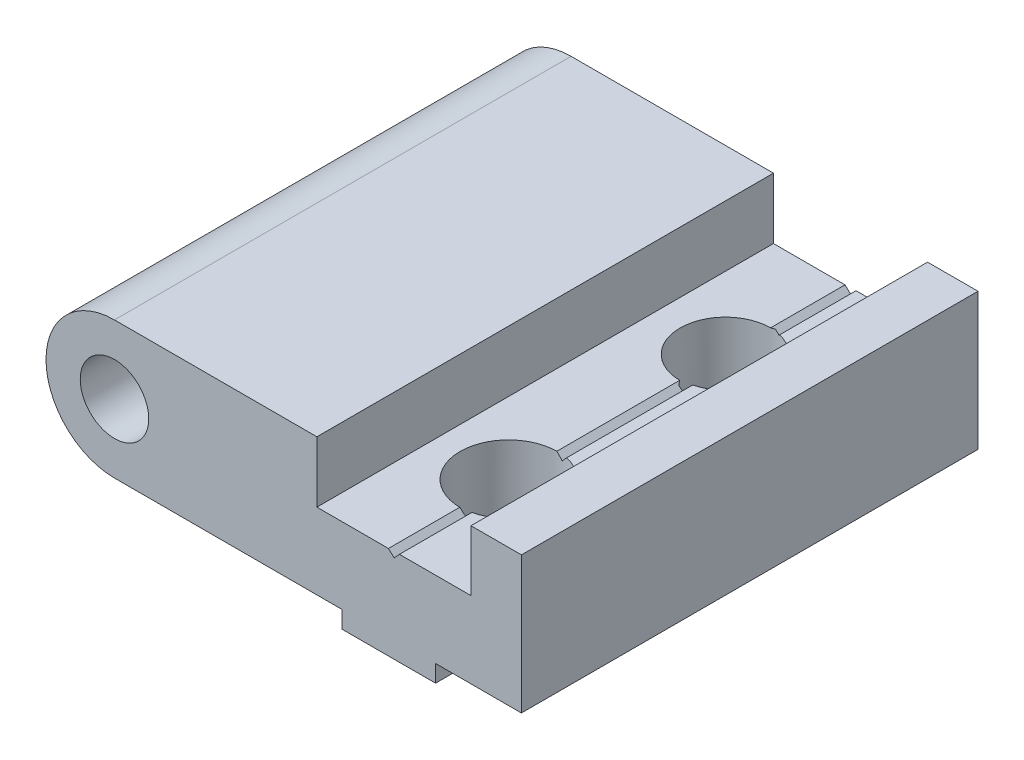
ISO-10303-21;
HEADER;
FILE_DESCRIPTION(('STEP AP214'),'2;1');
FILE_NAME('part.step','',(''),(''),'','','');
FILE_SCHEMA(('AUTOMOTIVE_DESIGN { 1 0 10303 214 1 1 1 1 }'));
ENDSEC;
DATA;
#1=APPLICATION_CONTEXT('core data for automotive mechanical design processes');
#2=APPLICATION_PROTOCOL_DEFINITION('international standard','automotive_design',2000,#1);
#3=PRODUCT_CONTEXT('',#1,'mechanical');
#4=PRODUCT('Part','Part','',(#3));
#5=PRODUCT_RELATED_PRODUCT_CATEGORY('part','',(#4));
#6=PRODUCT_DEFINITION_FORMATION('','',#4);
#7=PRODUCT_DEFINITION_CONTEXT('part definition',#1,'design');
#8=PRODUCT_DEFINITION('design','',#6,#7);
#9=PRODUCT_DEFINITION_SHAPE('','',#8);
#10=(LENGTH_UNIT() NAMED_UNIT(*) SI_UNIT(.MILLI.,.METRE.));
#11=(NAMED_UNIT(*) PLANE_ANGLE_UNIT() SI_UNIT($,.RADIAN.));
#12=(NAMED_UNIT(*) SI_UNIT($,.STERADIAN.) SOLID_ANGLE_UNIT());
#13=UNCERTAINTY_MEASURE_WITH_UNIT(LENGTH_MEASURE(1.E-05),#10,'distance_accuracy_value','');
#14=(GEOMETRIC_REPRESENTATION_CONTEXT(3) GLOBAL_UNCERTAINTY_ASSIGNED_CONTEXT((#13)) GLOBAL_UNIT_ASSIGNED_CONTEXT((#10,
#11,#12)) REPRESENTATION_CONTEXT('',''));
#15=CARTESIAN_POINT('',(0.,0.,0.));
#16=DIRECTION('',(0.,0.,1.));
#17=DIRECTION('',(1.,0.,0.));
#18=AXIS2_PLACEMENT_3D('',#15,#16,#17);
#19=CARTESIAN_POINT('',(0.463182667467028,6.69712197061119,0.));
#20=DIRECTION('',(-0.733599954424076,0.679581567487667,0.));
#21=DIRECTION('',(-0.679581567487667,-0.733599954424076,0.));
#22=AXIS2_PLACEMENT_3D('',#19,#20,#21);
#23=PLANE('',#22);
#24=DIRECTION('',(0.,0.,1.));
#25=VECTOR('',#24,1.);
#26=CARTESIAN_POINT('',(0.463182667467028,6.69712197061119,0.));
#27=LINE('',#26,#25);
#28=CARTESIAN_POINT('',(0.463182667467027,6.69712197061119,-25.6908944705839));
#29=VERTEX_POINT('',#28);
#30=CARTESIAN_POINT('',(0.463182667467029,6.69712197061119,-14.6461089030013));
#31=VERTEX_POINT('',#30);
#32=EDGE_CURVE('E238',#29,#31,#27,.T.);
#33=ORIENTED_EDGE('',*,*,#32,.F.);
#34=CARTESIAN_POINT('',(0.463182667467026,6.69712197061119,-25.6908944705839));
#35=CARTESIAN_POINT('',(0.43318842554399,6.66474355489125,-25.6281035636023));
#36=CARTESIAN_POINT('',(0.402974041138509,6.63212749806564,-25.565545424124));
#37=CARTESIAN_POINT('',(0.34210505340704,6.5664201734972,-25.4408948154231));
#38=CARTESIAN_POINT('',(0.311450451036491,6.53332890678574,-25.3788023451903));
#39=CARTESIAN_POINT('',(0.280575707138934,6.5,-25.3169426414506));
#40=B_SPLINE_CURVE_WITH_KNOTS('',3,(#34,#35,#36,#37,#38,#39),.UNSPECIFIED.,.F.,.F.,(4,2,4),(0.,
0.230243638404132,0.460486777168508),.UNSPECIFIED.);
#41=CARTESIAN_POINT('',(0.280575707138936,6.5,-25.3169426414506));
#42=VERTEX_POINT('',#41);
#43=EDGE_CURVE('E236',#29,#42,#40,.T.);
#44=ORIENTED_EDGE('',*,*,#43,.T.);
#45=CARTESIAN_POINT('',(-0.47077716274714,5.68892380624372,-29.5));
#46=DIRECTION('',(-0.733599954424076,0.679581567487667,0.));
#47=DIRECTION('',(0.679581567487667,0.733599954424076,0.));
#48=AXIS2_PLACEMENT_3D('',#45,#46,#47);
#49=ELLIPSE('',#48,6.25384825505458,4.25);
#50=CARTESIAN_POINT('',(0.,6.19712197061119,-25.2761547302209));
#51=VERTEX_POINT('',#50);
#52=EDGE_CURVE('E20',#42,#51,#49,.F.);
#53=ORIENTED_EDGE('',*,*,#52,.T.);
#54=DIRECTION('',(0.,0.,1.));
#55=VECTOR('',#54,1.);
#56=CARTESIAN_POINT('',(0.,6.19712197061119,0.));
#57=LINE('',#56,#55);
#58=CARTESIAN_POINT('',(0.,6.19712197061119,-14.7238452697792));
#59=VERTEX_POINT('',#58);
#60=EDGE_CURVE('E278',#59,#51,#57,.F.);
#61=ORIENTED_EDGE('',*,*,#60,.F.);
#62=CARTESIAN_POINT('',(-0.47077716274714,5.68892380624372,-10.5));
#63=DIRECTION('',(-0.733599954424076,0.679581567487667,0.));
#64=DIRECTION('',(0.679581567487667,0.733599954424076,0.));
#65=AXIS2_PLACEMENT_3D('',#62,#63,#64);
#66=ELLIPSE('',#65,6.25384825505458,4.25);
#67=EDGE_CURVE('E234',#59,#31,#66,.F.);
#68=ORIENTED_EDGE('',*,*,#67,.T.);
#69=EDGE_LOOP('',(#33,#44,#53,#61,#68));
#70=FACE_BOUND('',#69,.T.);
#71=ADVANCED_FACE('F16',(#70),#23,.T.);
#72=CARTESIAN_POINT('',(0.463182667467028,6.69712197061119,0.));
#73=DIRECTION('',(-0.733599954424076,0.679581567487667,0.));
#74=DIRECTION('',(-0.679581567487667,-0.733599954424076,0.));
#75=AXIS2_PLACEMENT_3D('',#72,#73,#74);
#76=PLANE('',#75);
#77=DIRECTION('',(-0.679581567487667,-0.733599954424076,0.));
#78=VECTOR('',#77,1.);
#79=CARTESIAN_POINT('',(0.463182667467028,6.69712197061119,0.));
#80=LINE('',#79,#78);
#81=CARTESIAN_POINT('',(0.,6.19712197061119,0.));
#82=VERTEX_POINT('',#81);
#83=CARTESIAN_POINT('',(0.463182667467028,6.69712197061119,0.));
#84=VERTEX_POINT('',#83);
#85=EDGE_CURVE('E302',#82,#84,#80,.F.);
#86=ORIENTED_EDGE('',*,*,#85,.T.);
#87=DIRECTION('',(0.,0.,1.));
#88=VECTOR('',#87,1.);
#89=CARTESIAN_POINT('',(0.463182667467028,6.69712197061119,0.));
#90=LINE('',#89,#88);
#91=CARTESIAN_POINT('',(0.463182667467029,6.69712197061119,-6.35389109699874));
#92=VERTEX_POINT('',#91);
#93=EDGE_CURVE('E640',#92,#84,#90,.T.);
#94=ORIENTED_EDGE('',*,*,#93,.F.);
#95=CARTESIAN_POINT('',(-0.47077716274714,5.68892380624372,-10.5));
#96=DIRECTION('',(-0.733599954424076,0.679581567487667,0.));
#97=DIRECTION('',(0.679581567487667,0.733599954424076,0.));
#98=AXIS2_PLACEMENT_3D('',#95,#96,#97);
#99=ELLIPSE('',#98,6.25384825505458,4.25);
#100=CARTESIAN_POINT('',(0.,6.19712197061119,-6.27615473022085));
#101=VERTEX_POINT('',#100);
#102=EDGE_CURVE('E304',#92,#101,#99,.F.);
#103=ORIENTED_EDGE('',*,*,#102,.T.);
#104=DIRECTION('',(0.,0.,1.));
#105=VECTOR('',#104,1.);
#106=CARTESIAN_POINT('',(0.,6.19712197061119,0.));
#107=LINE('',#106,#105);
#108=EDGE_CURVE('E281',#82,#101,#107,.F.);
#109=ORIENTED_EDGE('',*,*,#108,.F.);
#110=EDGE_LOOP('',(#86,#94,#103,#109));
#111=FACE_BOUND('',#110,.T.);
#112=ADVANCED_FACE('F745',(#111),#76,.T.);
#113=CARTESIAN_POINT('',(0.463182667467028,6.69712197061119,0.));
#114=DIRECTION('',(-0.733599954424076,0.679581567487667,0.));
#115=DIRECTION('',(-0.679581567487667,-0.733599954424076,0.));
#116=AXIS2_PLACEMENT_3D('',#113,#114,#115);
#117=PLANE('',#116);
#118=DIRECTION('',(-0.679581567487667,-0.733599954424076,0.));
#119=VECTOR('',#118,1.);
#120=CARTESIAN_POINT('',(0.463182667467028,6.69712197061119,-40.));
#121=LINE('',#120,#119);
#122=CARTESIAN_POINT('',(0.463182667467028,6.69712197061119,-40.));
#123=VERTEX_POINT('',#122);
#124=CARTESIAN_POINT('',(0.,6.19712197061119,-40.));
#125=VERTEX_POINT('',#124);
#126=EDGE_CURVE('E294',#123,#125,#121,.T.);
#127=ORIENTED_EDGE('',*,*,#126,.T.);
#128=DIRECTION('',(0.,0.,1.));
#129=VECTOR('',#128,1.);
#130=CARTESIAN_POINT('',(0.,6.19712197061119,0.));
#131=LINE('',#130,#129);
#132=CARTESIAN_POINT('',(0.,6.19712197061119,-33.7238452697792));
#133=VERTEX_POINT('',#132);
#134=EDGE_CURVE('E288',#133,#125,#131,.F.);
#135=ORIENTED_EDGE('',*,*,#134,.F.);
#136=CARTESIAN_POINT('',(-0.47077716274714,5.68892380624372,-29.5));
#137=DIRECTION('',(-0.733599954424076,0.679581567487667,0.));
#138=DIRECTION('',(0.679581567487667,0.733599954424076,0.));
#139=AXIS2_PLACEMENT_3D('',#136,#137,#138);
#140=ELLIPSE('',#139,6.25384825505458,4.25);
#141=CARTESIAN_POINT('',(0.280575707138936,6.5,-33.6830573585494));
#142=VERTEX_POINT('',#141);
#143=EDGE_CURVE('E296',#133,#142,#140,.F.);
#144=ORIENTED_EDGE('',*,*,#143,.T.);
#145=CARTESIAN_POINT('',(0.280575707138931,6.5,-33.6830573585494));
#146=CARTESIAN_POINT('',(0.311450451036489,6.53332890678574,-33.6211976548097));
#147=CARTESIAN_POINT('',(0.342105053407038,6.56642017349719,-33.5591051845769));
#148=CARTESIAN_POINT('',(0.402974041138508,6.63212749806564,-33.4344545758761));
#149=CARTESIAN_POINT('',(0.433188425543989,6.66474355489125,-33.3718964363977));
#150=CARTESIAN_POINT('',(0.463182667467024,6.69712197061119,-33.3091055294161));
#151=B_SPLINE_CURVE_WITH_KNOTS('',3,(#145,#146,#147,#148,#149,#150),.UNSPECIFIED.,.F.,.F.,(4,2,
4),(0.,0.230243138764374,0.460486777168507),.UNSPECIFIED.);
#152=CARTESIAN_POINT('',(0.463182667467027,6.69712197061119,-33.3091055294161));
#153=VERTEX_POINT('',#152);
#154=EDGE_CURVE('E242',#142,#153,#151,.T.);
#155=ORIENTED_EDGE('',*,*,#154,.T.);
#156=DIRECTION('',(0.,0.,1.));
#157=VECTOR('',#156,1.);
#158=CARTESIAN_POINT('',(0.463182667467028,6.69712197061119,0.));
#159=LINE('',#158,#157);
#160=EDGE_CURVE('E634',#123,#153,#159,.T.);
#161=ORIENTED_EDGE('',*,*,#160,.F.);
#162=EDGE_LOOP('',(#127,#135,#144,#155,#161));
#163=FACE_BOUND('',#162,.T.);
#164=ADVANCED_FACE('F738',(#163),#117,.T.);
#165=CARTESIAN_POINT('',(0.,6.19712197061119,0.));
#166=DIRECTION('',(0.679581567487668,0.733599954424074,0.));
#167=DIRECTION('',(-0.733599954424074,0.679581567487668,0.));
#168=AXIS2_PLACEMENT_3D('',#165,#166,#167);
#169=PLANE('',#168);
#170=DIRECTION('',(-0.733599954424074,0.679581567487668,0.));
#171=VECTOR('',#170,1.);
#172=CARTESIAN_POINT('',(0.,6.19712197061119,-40.));
#173=LINE('',#172,#171);
#174=CARTESIAN_POINT('',(-0.5,6.66030463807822,-40.));
#175=VERTEX_POINT('',#174);
#176=EDGE_CURVE('E291',#125,#175,#173,.T.);
#177=ORIENTED_EDGE('',*,*,#176,.T.);
#178=DIRECTION('',(0.,0.,1.));
#179=VECTOR('',#178,1.);
#180=CARTESIAN_POINT('',(-0.5,6.66030463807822,0.));
#181=LINE('',#180,#179);
#182=CARTESIAN_POINT('',(-0.499999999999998,6.66030463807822,-33.4831010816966));
#183=VERTEX_POINT('',#182);
#184=EDGE_CURVE('E631',#183,#175,#181,.F.);
#185=ORIENTED_EDGE('',*,*,#184,.F.);
#186=CARTESIAN_POINT('',(-0.499999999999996,6.66030463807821,-33.4831010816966));
#187=CARTESIAN_POINT('',(-0.471370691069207,6.63378343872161,-33.5274361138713));
#188=CARTESIAN_POINT('',(-0.442635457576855,6.60716411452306,-33.5716423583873));
#189=CARTESIAN_POINT('',(-0.384953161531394,6.55372923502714,-33.6597972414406));
#190=CARTESIAN_POINT('',(-0.35600609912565,6.52691367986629,-33.7037458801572));
#191=CARTESIAN_POINT('',(-0.326953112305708,6.5,-33.7475657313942));
#192=B_SPLINE_CURVE_WITH_KNOTS('',3,(#186,#187,#188,#189,#190,#191),.UNSPECIFIED.,.F.,.F.,(4,2,
4),(0.,0.177190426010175,0.354380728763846),.UNSPECIFIED.);
#193=CARTESIAN_POINT('',(-0.32695311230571,6.5,-33.7475657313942));
#194=VERTEX_POINT('',#193);
#195=EDGE_CURVE('E423',#183,#194,#192,.T.);
#196=ORIENTED_EDGE('',*,*,#195,.T.);
#197=CARTESIAN_POINT('',(-0.47077716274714,6.63323361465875,-29.5));
#198=DIRECTION('',(0.679581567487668,0.733599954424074,0.));
#199=DIRECTION('',(-0.733599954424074,0.679581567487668,0.));
#200=AXIS2_PLACEMENT_3D('',#197,#198,#199);
#201=ELLIPSE('',#200,5.7933482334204,4.25);
#202=EDGE_CURVE('E292',#194,#133,#201,.F.);
#203=ORIENTED_EDGE('',*,*,#202,.T.);
#204=ORIENTED_EDGE('',*,*,#134,.T.);
#205=EDGE_LOOP('',(#177,#185,#196,#203,#204));
#206=FACE_BOUND('',#205,.T.);
#207=ADVANCED_FACE('F735',(#206),#169,.T.);
#208=CARTESIAN_POINT('',(0.,6.19712197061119,0.));
#209=DIRECTION('',(0.679581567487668,0.733599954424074,0.));
#210=DIRECTION('',(-0.733599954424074,0.679581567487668,0.));
#211=AXIS2_PLACEMENT_3D('',#208,#209,#210);
#212=PLANE('',#211);
#213=DIRECTION('',(-0.733599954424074,0.679581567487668,0.));
#214=VECTOR('',#213,1.);
#215=CARTESIAN_POINT('',(0.,6.19712197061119,0.));
#216=LINE('',#215,#214);
#217=CARTESIAN_POINT('',(-0.5,6.66030463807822,0.));
#218=VERTEX_POINT('',#217);
#219=EDGE_CURVE('E284',#218,#82,#216,.F.);
#220=ORIENTED_EDGE('',*,*,#219,.T.);
#221=ORIENTED_EDGE('',*,*,#108,.T.);
#222=CARTESIAN_POINT('',(-0.47077716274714,6.63323361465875,-10.5));
#223=DIRECTION('',(0.679581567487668,0.733599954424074,0.));
#224=DIRECTION('',(-0.733599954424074,0.679581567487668,0.));
#225=AXIS2_PLACEMENT_3D('',#222,#223,#224);
#226=ELLIPSE('',#225,5.7933482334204,4.25);
#227=CARTESIAN_POINT('',(-0.5,6.66030463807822,-6.25010046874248));
#228=VERTEX_POINT('',#227);
#229=EDGE_CURVE('E287',#101,#228,#226,.F.);
#230=ORIENTED_EDGE('',*,*,#229,.T.);
#231=DIRECTION('',(0.,0.,1.));
#232=VECTOR('',#231,1.);
#233=CARTESIAN_POINT('',(-0.5,6.66030463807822,0.));
#234=LINE('',#233,#232);
#235=EDGE_CURVE('E628',#218,#228,#234,.F.);
#236=ORIENTED_EDGE('',*,*,#235,.F.);
#237=EDGE_LOOP('',(#220,#221,#230,#236));
#238=FACE_BOUND('',#237,.T.);
#239=ADVANCED_FACE('F412',(#238),#212,.T.);
#240=CARTESIAN_POINT('',(0.,6.19712197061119,0.));
#241=DIRECTION('',(0.679581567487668,0.733599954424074,0.));
#242=DIRECTION('',(-0.733599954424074,0.679581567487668,0.));
#243=AXIS2_PLACEMENT_3D('',#240,#241,#242);
#244=PLANE('',#243);
#245=ORIENTED_EDGE('',*,*,#60,.T.);
#246=CARTESIAN_POINT('',(-0.47077716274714,6.63323361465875,-29.5));
#247=DIRECTION('',(0.679581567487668,0.733599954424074,0.));
#248=DIRECTION('',(-0.733599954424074,0.679581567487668,0.));
#249=AXIS2_PLACEMENT_3D('',#246,#247,#248);
#250=ELLIPSE('',#249,5.7933482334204,4.25);
#251=CARTESIAN_POINT('',(-0.3269531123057,6.5,-25.2524342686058));
#252=VERTEX_POINT('',#251);
#253=EDGE_CURVE('E230',#51,#252,#250,.F.);
#254=ORIENTED_EDGE('',*,*,#253,.T.);
#255=CARTESIAN_POINT('',(-0.326953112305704,6.5,-25.2524342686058));
#256=CARTESIAN_POINT('',(-0.356006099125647,6.52691367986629,-25.2962541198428));
#257=CARTESIAN_POINT('',(-0.384953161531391,6.55372923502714,-25.3402027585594));
#258=CARTESIAN_POINT('',(-0.442635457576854,6.60716411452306,-25.4283576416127));
#259=CARTESIAN_POINT('',(-0.471370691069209,6.63378343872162,-25.4725638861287));
#260=CARTESIAN_POINT('',(-0.499999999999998,6.66030463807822,-25.5168989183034));
#261=B_SPLINE_CURVE_WITH_KNOTS('',3,(#255,#256,#257,#258,#259,#260),.UNSPECIFIED.,.F.,.F.,(4,2,
4),(0.,0.177190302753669,0.354380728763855),.UNSPECIFIED.);
#262=CARTESIAN_POINT('',(-0.499999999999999,6.66030463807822,-25.5168989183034));
#263=VERTEX_POINT('',#262);
#264=EDGE_CURVE('E416',#252,#263,#261,.T.);
#265=ORIENTED_EDGE('',*,*,#264,.T.);
#266=DIRECTION('',(0.,0.,1.));
#267=VECTOR('',#266,1.);
#268=CARTESIAN_POINT('',(-0.5,6.66030463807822,0.));
#269=LINE('',#268,#267);
#270=CARTESIAN_POINT('',(-0.5,6.66030463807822,-14.7498995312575));
#271=VERTEX_POINT('',#270);
#272=EDGE_CURVE('E624',#271,#263,#269,.F.);
#273=ORIENTED_EDGE('',*,*,#272,.F.);
#274=CARTESIAN_POINT('',(-0.47077716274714,6.63323361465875,-10.5));
#275=DIRECTION('',(0.679581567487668,0.733599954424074,0.));
#276=DIRECTION('',(-0.733599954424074,0.679581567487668,0.));
#277=AXIS2_PLACEMENT_3D('',#274,#275,#276);
#278=ELLIPSE('',#277,5.7933482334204,4.25);
#279=EDGE_CURVE('E280',#271,#59,#278,.F.);
#280=ORIENTED_EDGE('',*,*,#279,.T.);
#281=EDGE_LOOP('',(#245,#254,#265,#273,#280));
#282=FACE_BOUND('',#281,.T.);
#283=ADVANCED_FACE('F405',(#282),#244,.T.);
#284=CARTESIAN_POINT('',(3.62922283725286,-1.5,0.));
#285=DIRECTION('',(1.,0.,0.));
#286=DIRECTION('',(0.,0.,-1.));
#287=AXIS2_PLACEMENT_3D('',#284,#285,#286);
#288=PLANE('',#287);
#289=DIRECTION('',(0.,0.,-1.));
#290=VECTOR('',#289,1.);
#291=CARTESIAN_POINT('',(3.62922283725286,-1.5,0.));
#292=LINE('',#291,#290);
#293=CARTESIAN_POINT('',(3.62922283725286,-1.5,-7.22089951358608));
#294=VERTEX_POINT('',#293);
#295=CARTESIAN_POINT('',(3.62922283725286,-1.5,0.));
#296=VERTEX_POINT('',#295);
#297=EDGE_CURVE('E648',#294,#296,#292,.F.);
#298=ORIENTED_EDGE('',*,*,#297,.F.);
#299=CARTESIAN_POINT('',(3.62922283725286,-1.50000000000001,-7.22089951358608));
#300=CARTESIAN_POINT('',(3.62922283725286,-1.44719052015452,-7.30546101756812));
#301=CARTESIAN_POINT('',(3.62922283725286,-1.39526598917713,-7.39057706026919));
#302=CARTESIAN_POINT('',(3.62922283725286,-1.29348299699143,-7.56205938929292));
#303=CARTESIAN_POINT('',(3.62922283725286,-1.24362499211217,-7.64842594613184));
#304=CARTESIAN_POINT('',(3.62922283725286,-1.09817894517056,-7.90857449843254));
#305=CARTESIAN_POINT('',(3.62922283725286,-1.00611575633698,-8.0843575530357));
#306=CARTESIAN_POINT('',(3.62922283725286,-0.834595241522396,-8.44251356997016));
#307=CARTESIAN_POINT('',(3.62922283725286,-0.755161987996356,-8.62489832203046));
#308=CARTESIAN_POINT('',(3.62922283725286,-0.648856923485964,-8.90395134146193));
#309=CARTESIAN_POINT('',(3.62922283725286,-0.615489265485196,-8.99814663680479));
#310=CARTESIAN_POINT('',(3.62922283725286,-0.553789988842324,-9.18824308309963));
#311=CARTESIAN_POINT('',(3.62922283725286,-0.525462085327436,-9.2841454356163));
#312=CARTESIAN_POINT('',(3.62922283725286,-0.500000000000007,-9.38084853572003));
#313=B_SPLINE_CURVE_WITH_KNOTS('',3,(#299,#300,#301,#302,#303,#304,#305,#306,#307,#308,#309,
#310,#311,#312),.UNSPECIFIED.,.F.,.F.,(4,2,2,2,2,2,4),(0.,0.299084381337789,0.598234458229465,
1.19315738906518,1.78920098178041,2.08886510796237,2.38874922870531),.UNSPECIFIED.);
#314=CARTESIAN_POINT('',(3.62922283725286,-0.500000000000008,-9.38084853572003));
#315=VERTEX_POINT('',#314);
#316=EDGE_CURVE('E384',#294,#315,#313,.T.);
#317=ORIENTED_EDGE('',*,*,#316,.T.);
#318=DIRECTION('',(0.,1.,0.));
#319=VECTOR('',#318,1.);
#320=CARTESIAN_POINT('',(3.62922283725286,-1.5,-9.38084853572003));
#321=LINE('',#320,#319);
#322=CARTESIAN_POINT('',(3.62922283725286,0.,-9.38084853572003));
#323=VERTEX_POINT('',#322);
#324=EDGE_CURVE('E265',#315,#323,#321,.T.);
#325=ORIENTED_EDGE('',*,*,#324,.T.);
#326=DIRECTION('',(0.,0.,-1.));
#327=VECTOR('',#326,1.);
#328=CARTESIAN_POINT('',(3.62922283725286,0.,0.));
#329=LINE('',#328,#327);
#330=CARTESIAN_POINT('',(3.62922283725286,0.,0.));
#331=VERTEX_POINT('',#330);
#332=EDGE_CURVE('E609',#331,#323,#329,.T.);
#333=ORIENTED_EDGE('',*,*,#332,.F.);
#334=DIRECTION('',(0.,1.,0.));
#335=VECTOR('',#334,1.);
#336=CARTESIAN_POINT('',(3.62922283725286,-1.5,0.));
#337=LINE('',#336,#335);
#338=EDGE_CURVE('E264',#331,#296,#337,.F.);
#339=ORIENTED_EDGE('',*,*,#338,.T.);
#340=EDGE_LOOP('',(#298,#317,#325,#333,#339));
#341=FACE_BOUND('',#340,.T.);
#342=ADVANCED_FACE('F400',(#341),#288,.T.);
#343=CARTESIAN_POINT('',(3.62922283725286,-1.5,0.));
#344=DIRECTION('',(1.,0.,0.));
#345=DIRECTION('',(0.,0.,-1.));
#346=AXIS2_PLACEMENT_3D('',#343,#344,#345);
#347=PLANE('',#346);
#348=CARTESIAN_POINT('',(3.62922283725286,-0.500000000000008,-11.61915146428));
#349=CARTESIAN_POINT('',(3.62922283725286,-0.525462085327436,-11.7158545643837));
#350=CARTESIAN_POINT('',(3.62922283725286,-0.553789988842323,-11.8117569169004));
#351=CARTESIAN_POINT('',(3.62922283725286,-0.615489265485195,-12.0018533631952));
#352=CARTESIAN_POINT('',(3.62922283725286,-0.648856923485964,-12.0960486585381));
#353=CARTESIAN_POINT('',(3.62922283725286,-0.755161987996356,-12.3751016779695));
#354=CARTESIAN_POINT('',(3.62922283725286,-0.834595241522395,-12.5574864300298));
#355=CARTESIAN_POINT('',(3.62922283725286,-1.00611575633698,-12.9156424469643));
#356=CARTESIAN_POINT('',(3.62922283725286,-1.09817894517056,-13.0914255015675));
#357=CARTESIAN_POINT('',(3.62922283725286,-1.24362499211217,-13.3515740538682));
#358=CARTESIAN_POINT('',(3.62922283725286,-1.29348299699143,-13.4379406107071));
#359=CARTESIAN_POINT('',(3.62922283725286,-1.39526598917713,-13.6094229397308));
#360=CARTESIAN_POINT('',(3.62922283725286,-1.44719052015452,-13.6945389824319));
#361=CARTESIAN_POINT('',(3.62922283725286,-1.50000000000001,-13.7791004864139));
#362=B_SPLINE_CURVE_WITH_KNOTS('',3,(#348,#349,#350,#351,#352,#353,#354,#355,#356,#357,#358,
#359,#360,#361),.UNSPECIFIED.,.F.,.F.,(4,2,2,2,2,2,4),(0.,0.299884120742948,0.599548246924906,
1.19559183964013,1.79051477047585,2.08966484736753,2.38874922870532),.UNSPECIFIED.);
#363=CARTESIAN_POINT('',(3.62922283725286,-0.500000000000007,-11.61915146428));
#364=VERTEX_POINT('',#363);
#365=CARTESIAN_POINT('',(3.62922283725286,-1.5,-13.7791004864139));
#366=VERTEX_POINT('',#365);
#367=EDGE_CURVE('E393',#364,#366,#362,.T.);
#368=ORIENTED_EDGE('',*,*,#367,.T.);
#369=DIRECTION('',(0.,0.,-1.));
#370=VECTOR('',#369,1.);
#371=CARTESIAN_POINT('',(3.62922283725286,-1.5,0.));
#372=LINE('',#371,#370);
#373=CARTESIAN_POINT('',(3.62922283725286,-1.5,-26.2208995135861));
#374=VERTEX_POINT('',#373);
#375=EDGE_CURVE('E461',#374,#366,#372,.F.);
#376=ORIENTED_EDGE('',*,*,#375,.F.);
#377=CARTESIAN_POINT('',(3.62922283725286,-1.5,-26.2208995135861));
#378=CARTESIAN_POINT('',(3.62922283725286,-1.44719052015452,-26.3054610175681));
#379=CARTESIAN_POINT('',(3.62922283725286,-1.39526598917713,-26.3905770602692));
#380=CARTESIAN_POINT('',(3.62922283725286,-1.29348299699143,-26.5620593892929));
#381=CARTESIAN_POINT('',(3.62922283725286,-1.24362499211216,-26.6484259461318));
#382=CARTESIAN_POINT('',(3.62922283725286,-1.09817894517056,-26.9085744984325));
#383=CARTESIAN_POINT('',(3.62922283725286,-1.00611575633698,-27.0843575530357));
#384=CARTESIAN_POINT('',(3.62922283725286,-0.834595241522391,-27.4425135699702));
#385=CARTESIAN_POINT('',(3.62922283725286,-0.755161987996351,-27.6248983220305));
#386=CARTESIAN_POINT('',(3.62922283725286,-0.648856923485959,-27.9039513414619));
#387=CARTESIAN_POINT('',(3.62922283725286,-0.615489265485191,-27.9981466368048));
#388=CARTESIAN_POINT('',(3.62922283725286,-0.553789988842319,-28.1882430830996));
#389=CARTESIAN_POINT('',(3.62922283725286,-0.525462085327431,-28.2841454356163));
#390=CARTESIAN_POINT('',(3.62922283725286,-0.500000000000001,-28.38084853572));
#391=B_SPLINE_CURVE_WITH_KNOTS('',3,(#377,#378,#379,#380,#381,#382,#383,#384,#385,#386,#387,
#388,#389,#390),.UNSPECIFIED.,.F.,.F.,(4,2,2,2,2,2,4),(0.,0.299084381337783,0.598234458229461,
1.19315738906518,1.78920098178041,2.08886510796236,2.38874922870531),.UNSPECIFIED.);
#392=CARTESIAN_POINT('',(3.62922283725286,-0.500000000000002,-28.38084853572));
#393=VERTEX_POINT('',#392);
#394=EDGE_CURVE('E453',#374,#393,#391,.T.);
#395=ORIENTED_EDGE('',*,*,#394,.T.);
#396=DIRECTION('',(0.,1.,0.));
#397=VECTOR('',#396,1.);
#398=CARTESIAN_POINT('',(3.62922283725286,-1.5,-28.38084853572));
#399=LINE('',#398,#397);
#400=CARTESIAN_POINT('',(3.62922283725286,0.,-28.38084853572));
#401=VERTEX_POINT('',#400);
#402=EDGE_CURVE('E262',#393,#401,#399,.T.);
#403=ORIENTED_EDGE('',*,*,#402,.T.);
#404=DIRECTION('',(0.,0.,-1.));
#405=VECTOR('',#404,1.);
#406=CARTESIAN_POINT('',(3.62922283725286,0.,0.));
#407=LINE('',#406,#405);
#408=CARTESIAN_POINT('',(3.62922283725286,0.,-11.61915146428));
#409=VERTEX_POINT('',#408);
#410=EDGE_CURVE('E607',#409,#401,#407,.T.);
#411=ORIENTED_EDGE('',*,*,#410,.F.);
#412=DIRECTION('',(0.,1.,0.));
#413=VECTOR('',#412,1.);
#414=CARTESIAN_POINT('',(3.62922283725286,-1.5,-11.61915146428));
#415=LINE('',#414,#413);
#416=EDGE_CURVE('E260',#409,#364,#415,.F.);
#417=ORIENTED_EDGE('',*,*,#416,.T.);
#418=EDGE_LOOP('',(#368,#376,#395,#403,#411,#417));
#419=FACE_BOUND('',#418,.T.);
#420=ADVANCED_FACE('F404',(#419),#347,.T.);
#421=CARTESIAN_POINT('',(3.62922283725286,-1.5,0.));
#422=DIRECTION('',(1.,0.,0.));
#423=DIRECTION('',(0.,0.,-1.));
#424=AXIS2_PLACEMENT_3D('',#421,#422,#423);
#425=PLANE('',#424);
#426=DIRECTION('',(0.,0.,-1.));
#427=VECTOR('',#426,1.);
#428=CARTESIAN_POINT('',(3.62922283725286,0.,0.));
#429=LINE('',#428,#427);
#430=CARTESIAN_POINT('',(3.62922283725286,0.,-30.61915146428));
#431=VERTEX_POINT('',#430);
#432=CARTESIAN_POINT('',(3.62922283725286,0.,-40.));
#433=VERTEX_POINT('',#432);
#434=EDGE_CURVE('E612',#431,#433,#429,.T.);
#435=ORIENTED_EDGE('',*,*,#434,.F.);
#436=DIRECTION('',(0.,1.,0.));
#437=VECTOR('',#436,1.);
#438=CARTESIAN_POINT('',(3.62922283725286,-1.5,-30.61915146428));
#439=LINE('',#438,#437);
#440=CARTESIAN_POINT('',(3.62922283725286,-0.500000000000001,-30.61915146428));
#441=VERTEX_POINT('',#440);
#442=EDGE_CURVE('E243',#431,#441,#439,.F.);
#443=ORIENTED_EDGE('',*,*,#442,.T.);
#444=CARTESIAN_POINT('',(3.62922283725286,-0.500000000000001,-30.61915146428));
#445=CARTESIAN_POINT('',(3.62922283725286,-0.52546208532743,-30.7158545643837));
#446=CARTESIAN_POINT('',(3.62922283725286,-0.553789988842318,-30.8117569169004));
#447=CARTESIAN_POINT('',(3.62922283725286,-0.61548926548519,-31.0018533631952));
#448=CARTESIAN_POINT('',(3.62922283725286,-0.648856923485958,-31.0960486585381));
#449=CARTESIAN_POINT('',(3.62922283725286,-0.75516198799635,-31.3751016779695));
#450=CARTESIAN_POINT('',(3.62922283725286,-0.834595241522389,-31.5574864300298));
#451=CARTESIAN_POINT('',(3.62922283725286,-1.00611575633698,-31.9156424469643));
#452=CARTESIAN_POINT('',(3.62922283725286,-1.09817894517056,-32.0914255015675));
#453=CARTESIAN_POINT('',(3.62922283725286,-1.24362499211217,-32.3515740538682));
#454=CARTESIAN_POINT('',(3.62922283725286,-1.29348299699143,-32.4379406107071));
#455=CARTESIAN_POINT('',(3.62922283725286,-1.39526598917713,-32.6094229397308));
#456=CARTESIAN_POINT('',(3.62922283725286,-1.44719052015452,-32.6945389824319));
#457=CARTESIAN_POINT('',(3.62922283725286,-1.5,-32.7791004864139));
#458=B_SPLINE_CURVE_WITH_KNOTS('',3,(#444,#445,#446,#447,#448,#449,#450,#451,#452,#453,#454,
#455,#456,#457),.UNSPECIFIED.,.F.,.F.,(4,2,2,2,2,2,4),(0.,0.299884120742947,0.599548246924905,
1.19559183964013,1.79051477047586,2.08966484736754,2.38874922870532),.UNSPECIFIED.);
#459=CARTESIAN_POINT('',(3.62922283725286,-1.5,-32.7791004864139));
#460=VERTEX_POINT('',#459);
#461=EDGE_CURVE('E253',#441,#460,#458,.T.);
#462=ORIENTED_EDGE('',*,*,#461,.T.);
#463=DIRECTION('',(0.,0.,-1.));
#464=VECTOR('',#463,1.);
#465=CARTESIAN_POINT('',(3.62922283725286,-1.5,0.));
#466=LINE('',#465,#464);
#467=CARTESIAN_POINT('',(3.62922283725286,-1.5,-40.));
#468=VERTEX_POINT('',#467);
#469=EDGE_CURVE('E489',#468,#460,#466,.F.);
#470=ORIENTED_EDGE('',*,*,#469,.F.);
#471=DIRECTION('',(0.,1.,0.));
#472=VECTOR('',#471,1.);
#473=CARTESIAN_POINT('',(3.62922283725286,-1.5,-40.));
#474=LINE('',#473,#472);
#475=EDGE_CURVE('E258',#468,#433,#474,.T.);
#476=ORIENTED_EDGE('',*,*,#475,.T.);
#477=EDGE_LOOP('',(#435,#443,#462,#470,#476));
#478=FACE_BOUND('',#477,.T.);
#479=ADVANCED_FACE('F491',(#478),#425,.T.);
#480=CARTESIAN_POINT('',(-0.47077716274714,6.5,-29.5));
#481=DIRECTION('',(0.,-1.,0.));
#482=DIRECTION('',(0.,0.,-1.));
#483=AXIS2_PLACEMENT_3D('',#480,#481,#482);
#484=CONICAL_SURFACE('',#483,4.25,1.02974425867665);
#485=CARTESIAN_POINT('',(-0.47077716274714,6.5,-29.5));
#486=DIRECTION('',(0.,-1.,0.));
#487=DIRECTION('',(1.,0.,0.));
#488=AXIS2_PLACEMENT_3D('',#485,#486,#487);
#489=CIRCLE('',#488,4.25);
#490=EDGE_CURVE('E229',#142,#42,#489,.T.);
#491=ORIENTED_EDGE('',*,*,#490,.T.);
#492=ORIENTED_EDGE('',*,*,#43,.F.);
#493=CARTESIAN_POINT('',(-0.47077716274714,6.69712197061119,-29.5));
#494=DIRECTION('',(0.,1.,0.));
#495=DIRECTION('',(0.,0.,1.));
#496=AXIS2_PLACEMENT_3D('',#493,#494,#495);
#497=CIRCLE('',#496,3.9219339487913);
#498=EDGE_CURVE('E644',#153,#29,#497,.F.);
#499=ORIENTED_EDGE('',*,*,#498,.F.);
#500=ORIENTED_EDGE('',*,*,#154,.F.);
#501=EDGE_LOOP('',(#491,#492,#499,#500));
#502=FACE_BOUND('',#501,.T.);
#503=ADVANCED_FACE('F246',(#502),#484,.F.);
#504=CARTESIAN_POINT('',(-0.47077716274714,6.5,-29.5));
#505=DIRECTION('',(0.,-1.,0.));
#506=DIRECTION('',(0.,0.,-1.));
#507=AXIS2_PLACEMENT_3D('',#504,#505,#506);
#508=CONICAL_SURFACE('',#507,4.25,1.02974425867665);
#509=CARTESIAN_POINT('',(-0.47077716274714,6.66030463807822,-29.5));
#510=DIRECTION('',(0.,1.,0.));
#511=DIRECTION('',(0.,0.,1.));
#512=AXIS2_PLACEMENT_3D('',#509,#510,#511);
#513=CIRCLE('',#512,3.9832082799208);
#514=EDGE_CURVE('E490',#263,#183,#513,.F.);
#515=ORIENTED_EDGE('',*,*,#514,.F.);
#516=ORIENTED_EDGE('',*,*,#264,.F.);
#517=CARTESIAN_POINT('',(-0.47077716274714,6.5,-29.5));
#518=DIRECTION('',(0.,-1.,0.));
#519=DIRECTION('',(1.,0.,0.));
#520=AXIS2_PLACEMENT_3D('',#517,#518,#519);
#521=CIRCLE('',#520,4.25);
#522=EDGE_CURVE('E247',#252,#194,#521,.T.);
#523=ORIENTED_EDGE('',*,*,#522,.T.);
#524=ORIENTED_EDGE('',*,*,#195,.F.);
#525=EDGE_LOOP('',(#515,#516,#523,#524));
#526=FACE_BOUND('',#525,.T.);
#527=ADVANCED_FACE('F433',(#526),#508,.F.);
#528=CARTESIAN_POINT('',(-0.47077716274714,-1.5,-29.5));
#529=DIRECTION('',(0.,-1.,0.));
#530=DIRECTION('',(0.,0.,-1.));
#531=AXIS2_PLACEMENT_3D('',#528,#529,#530);
#532=CONICAL_SURFACE('',#531,5.25,0.785398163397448);
#533=CARTESIAN_POINT('',(-0.47077716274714,-0.500000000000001,-29.5));
#534=DIRECTION('',(0.,1.,0.));
#535=DIRECTION('',(0.,0.,1.));
#536=AXIS2_PLACEMENT_3D('',#533,#534,#535);
#537=CIRCLE('',#536,4.25);
#538=CARTESIAN_POINT('',(-4.57077716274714,-0.5,-28.38084853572));
#539=VERTEX_POINT('',#538);
#540=EDGE_CURVE('E251',#539,#393,#537,.T.);
#541=ORIENTED_EDGE('',*,*,#540,.T.);
#542=ORIENTED_EDGE('',*,*,#394,.F.);
#543=CARTESIAN_POINT('',(-0.47077716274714,-1.5,-29.5));
#544=DIRECTION('',(0.,-1.,0.));
#545=DIRECTION('',(0.,0.,-1.));
#546=AXIS2_PLACEMENT_3D('',#543,#544,#545);
#547=CIRCLE('',#546,5.25);
#548=CARTESIAN_POINT('',(-4.57077716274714,-1.5,-26.2208995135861));
#549=VERTEX_POINT('',#548);
#550=EDGE_CURVE('E459',#549,#374,#547,.F.);
#551=ORIENTED_EDGE('',*,*,#550,.F.);
#552=CARTESIAN_POINT('',(-4.57077716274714,-0.500000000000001,-28.38084853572));
#553=CARTESIAN_POINT('',(-4.57077716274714,-0.525462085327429,-28.2841454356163));
#554=CARTESIAN_POINT('',(-4.57077716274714,-0.553789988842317,-28.1882430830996));
#555=CARTESIAN_POINT('',(-4.57077716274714,-0.615489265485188,-27.9981466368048));
#556=CARTESIAN_POINT('',(-4.57077716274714,-0.648856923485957,-27.9039513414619));
#557=CARTESIAN_POINT('',(-4.57077716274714,-0.755161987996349,-27.6248983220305));
#558=CARTESIAN_POINT('',(-4.57077716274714,-0.83459524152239,-27.4425135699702));
#559=CARTESIAN_POINT('',(-4.57077716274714,-1.00611575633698,-27.0843575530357));
#560=CARTESIAN_POINT('',(-4.57077716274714,-1.09817894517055,-26.9085744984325));
#561=CARTESIAN_POINT('',(-4.57077716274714,-1.24362499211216,-26.6484259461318));
#562=CARTESIAN_POINT('',(-4.57077716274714,-1.29348299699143,-26.5620593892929));
#563=CARTESIAN_POINT('',(-4.57077716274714,-1.39526598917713,-26.3905770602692));
#564=CARTESIAN_POINT('',(-4.57077716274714,-1.44719052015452,-26.3054610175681));
#565=CARTESIAN_POINT('',(-4.57077716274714,-1.5,-26.2208995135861));
#566=B_SPLINE_CURVE_WITH_KNOTS('',3,(#552,#553,#554,#555,#556,#557,#558,#559,#560,#561,#562,
#563,#564,#565),.UNSPECIFIED.,.F.,.F.,(4,2,2,2,2,2,4),(0.,0.299884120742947,0.599548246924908,
1.19559183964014,1.79051477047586,2.08966484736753,2.38874922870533),.UNSPECIFIED.);
#567=EDGE_CURVE('E447',#539,#549,#566,.T.);
#568=ORIENTED_EDGE('',*,*,#567,.F.);
#569=EDGE_LOOP('',(#541,#542,#551,#568));
#570=FACE_BOUND('',#569,.T.);
#571=ADVANCED_FACE('F436',(#570),#532,.F.);
#572=CARTESIAN_POINT('',(-4.57077716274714,-1.5,0.));
#573=DIRECTION('',(0.,-1.,0.));
#574=DIRECTION('',(0.,0.,-1.));
#575=AXIS2_PLACEMENT_3D('',#572,#573,#574);
#576=PLANE('',#575);
#577=CARTESIAN_POINT('',(-0.470777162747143,-1.5,-10.5));
#578=DIRECTION('',(0.,-1.,0.));
#579=DIRECTION('',(0.,0.,-1.));
#580=AXIS2_PLACEMENT_3D('',#577,#578,#579);
#581=CIRCLE('',#580,5.25);
#582=CARTESIAN_POINT('',(-4.57077716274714,-1.5,-13.7791004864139));
#583=VERTEX_POINT('',#582);
#584=EDGE_CURVE('E462',#366,#583,#581,.F.);
#585=ORIENTED_EDGE('',*,*,#584,.T.);
#586=DIRECTION('',(0.,0.,1.));
#587=VECTOR('',#586,1.);
#588=CARTESIAN_POINT('',(-4.57077716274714,-1.5,0.));
#589=LINE('',#588,#587);
#590=EDGE_CURVE('E592',#549,#583,#589,.T.);
#591=ORIENTED_EDGE('',*,*,#590,.F.);
#592=ORIENTED_EDGE('',*,*,#550,.T.);
#593=ORIENTED_EDGE('',*,*,#375,.T.);
#594=EDGE_LOOP('',(#585,#591,#592,#593));
#595=FACE_BOUND('',#594,.T.);
#596=ADVANCED_FACE('F443',(#595),#576,.T.);
#597=CARTESIAN_POINT('',(-0.470777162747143,-1.5,-10.5));
#598=DIRECTION('',(0.,-1.,0.));
#599=DIRECTION('',(0.,0.,-1.));
#600=AXIS2_PLACEMENT_3D('',#597,#598,#599);
#601=CONICAL_SURFACE('',#600,5.25,0.785398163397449);
#602=CARTESIAN_POINT('',(-0.47077716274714,-0.500000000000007,-10.5));
#603=DIRECTION('',(0.,1.,0.));
#604=DIRECTION('',(-1.,0.,0.));
#605=AXIS2_PLACEMENT_3D('',#602,#603,#604);
#606=CIRCLE('',#605,4.25);
#607=CARTESIAN_POINT('',(-4.57077716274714,-0.500000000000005,-11.61915146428));
#608=VERTEX_POINT('',#607);
#609=EDGE_CURVE('E471',#364,#608,#606,.T.);
#610=ORIENTED_EDGE('',*,*,#609,.T.);
#611=CARTESIAN_POINT('',(-4.57077716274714,-1.5,-13.7791004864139));
#612=CARTESIAN_POINT('',(-4.57077716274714,-1.44719052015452,-13.6945389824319));
#613=CARTESIAN_POINT('',(-4.57077716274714,-1.39526598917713,-13.6094229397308));
#614=CARTESIAN_POINT('',(-4.57077716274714,-1.29348299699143,-13.4379406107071));
#615=CARTESIAN_POINT('',(-4.57077716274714,-1.24362499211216,-13.3515740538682));
#616=CARTESIAN_POINT('',(-4.57077716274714,-1.09817894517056,-13.0914255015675));
#617=CARTESIAN_POINT('',(-4.57077716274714,-1.00611575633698,-12.9156424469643));
#618=CARTESIAN_POINT('',(-4.57077716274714,-0.83459524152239,-12.5574864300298));
#619=CARTESIAN_POINT('',(-4.57077716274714,-0.75516198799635,-12.3751016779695));
#620=CARTESIAN_POINT('',(-4.57077716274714,-0.648856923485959,-12.0960486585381));
#621=CARTESIAN_POINT('',(-4.57077716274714,-0.61548926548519,-12.0018533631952));
#622=CARTESIAN_POINT('',(-4.57077716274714,-0.553789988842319,-11.8117569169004));
#623=CARTESIAN_POINT('',(-4.57077716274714,-0.525462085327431,-11.7158545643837));
#624=CARTESIAN_POINT('',(-4.57077716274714,-0.500000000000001,-11.61915146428));
#625=B_SPLINE_CURVE_WITH_KNOTS('',3,(#611,#612,#613,#614,#615,#616,#617,#618,#619,#620,#621,
#622,#623,#624),.UNSPECIFIED.,.F.,.F.,(4,2,2,2,2,2,4),(0.,0.299084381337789,0.598234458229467,
1.19315738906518,1.78920098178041,2.08886510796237,2.38874922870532),.UNSPECIFIED.);
#626=EDGE_CURVE('E595',#583,#608,#625,.T.);
#627=ORIENTED_EDGE('',*,*,#626,.F.);
#628=ORIENTED_EDGE('',*,*,#584,.F.);
#629=ORIENTED_EDGE('',*,*,#367,.F.);
#630=EDGE_LOOP('',(#610,#627,#628,#629));
#631=FACE_BOUND('',#630,.T.);
#632=ADVANCED_FACE('F378',(#631),#601,.F.);
#633=CARTESIAN_POINT('',(-0.470777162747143,-1.5,-10.5));
#634=DIRECTION('',(0.,-1.,0.));
#635=DIRECTION('',(0.,0.,-1.));
#636=AXIS2_PLACEMENT_3D('',#633,#634,#635);
#637=CONICAL_SURFACE('',#636,5.25,0.785398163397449);
#638=CARTESIAN_POINT('',(-0.470777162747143,-1.5,-10.5));
#639=DIRECTION('',(0.,-1.,0.));
#640=DIRECTION('',(0.,0.,-1.));
#641=AXIS2_PLACEMENT_3D('',#638,#639,#640);
#642=CIRCLE('',#641,5.25);
#643=CARTESIAN_POINT('',(-4.57077716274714,-1.5,-7.22089951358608));
#644=VERTEX_POINT('',#643);
#645=EDGE_CURVE('E392',#644,#294,#642,.F.);
#646=ORIENTED_EDGE('',*,*,#645,.F.);
#647=CARTESIAN_POINT('',(-4.57077716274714,-0.500000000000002,-9.38084853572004));
#648=CARTESIAN_POINT('',(-4.57077716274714,-0.52546208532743,-9.2841454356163));
#649=CARTESIAN_POINT('',(-4.57077716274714,-0.553789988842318,-9.18824308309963));
#650=CARTESIAN_POINT('',(-4.57077716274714,-0.615489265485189,-8.9981466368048));
#651=CARTESIAN_POINT('',(-4.57077716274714,-0.648856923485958,-8.90395134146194));
#652=CARTESIAN_POINT('',(-4.57077716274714,-0.75516198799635,-8.62489832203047));
#653=CARTESIAN_POINT('',(-4.57077716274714,-0.83459524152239,-8.44251356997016));
#654=CARTESIAN_POINT('',(-4.57077716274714,-1.00611575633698,-8.0843575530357));
#655=CARTESIAN_POINT('',(-4.57077716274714,-1.09817894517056,-7.90857449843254));
#656=CARTESIAN_POINT('',(-4.57077716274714,-1.24362499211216,-7.64842594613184));
#657=CARTESIAN_POINT('',(-4.57077716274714,-1.29348299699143,-7.56205938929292));
#658=CARTESIAN_POINT('',(-4.57077716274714,-1.39526598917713,-7.39057706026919));
#659=CARTESIAN_POINT('',(-4.57077716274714,-1.44719052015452,-7.30546101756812));
#660=CARTESIAN_POINT('',(-4.57077716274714,-1.5,-7.22089951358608));
#661=B_SPLINE_CURVE_WITH_KNOTS('',3,(#647,#648,#649,#650,#651,#652,#653,#654,#655,#656,#657,
#658,#659,#660),.UNSPECIFIED.,.F.,.F.,(4,2,2,2,2,2,4),(0.,0.299884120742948,0.599548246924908,
1.19559183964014,1.79051477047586,2.08966484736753,2.38874922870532),.UNSPECIFIED.);
#662=CARTESIAN_POINT('',(-4.57077716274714,-0.500000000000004,-9.38084853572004));
#663=VERTEX_POINT('',#662);
#664=EDGE_CURVE('E360',#663,#644,#661,.T.);
#665=ORIENTED_EDGE('',*,*,#664,.F.);
#666=CARTESIAN_POINT('',(-0.47077716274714,-0.500000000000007,-10.5));
#667=DIRECTION('',(0.,1.,0.));
#668=DIRECTION('',(-1.,0.,0.));
#669=AXIS2_PLACEMENT_3D('',#666,#667,#668);
#670=CIRCLE('',#669,4.25);
#671=EDGE_CURVE('E368',#663,#315,#670,.T.);
#672=ORIENTED_EDGE('',*,*,#671,.T.);
#673=ORIENTED_EDGE('',*,*,#316,.F.);
#674=EDGE_LOOP('',(#646,#665,#672,#673));
#675=FACE_BOUND('',#674,.T.);
#676=ADVANCED_FACE('F373',(#675),#637,.F.);
#677=CARTESIAN_POINT('',(-4.57077716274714,-1.5,0.));
#678=DIRECTION('',(0.,-1.,0.));
#679=DIRECTION('',(0.,0.,-1.));
#680=AXIS2_PLACEMENT_3D('',#677,#678,#679);
#681=PLANE('',#680);
#682=DIRECTION('',(1.,0.,0.));
#683=VECTOR('',#682,1.);
#684=CARTESIAN_POINT('',(-7.49369888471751,-1.5,0.));
#685=LINE('',#684,#683);
#686=CARTESIAN_POINT('',(-4.57077716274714,-1.5,0.));
#687=VERTEX_POINT('',#686);
#688=EDGE_CURVE('E586',#687,#296,#685,.T.);
#689=ORIENTED_EDGE('',*,*,#688,.F.);
#690=DIRECTION('',(0.,0.,1.));
#691=VECTOR('',#690,1.);
#692=CARTESIAN_POINT('',(-4.57077716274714,-1.5,0.));
#693=LINE('',#692,#691);
#694=EDGE_CURVE('E367',#644,#687,#693,.T.);
#695=ORIENTED_EDGE('',*,*,#694,.F.);
#696=ORIENTED_EDGE('',*,*,#645,.T.);
#697=ORIENTED_EDGE('',*,*,#297,.T.);
#698=EDGE_LOOP('',(#689,#695,#696,#697));
#699=FACE_BOUND('',#698,.T.);
#700=ADVANCED_FACE('F377',(#699),#681,.T.);
#701=CARTESIAN_POINT('',(11.15,12.,0.));
#702=DIRECTION('',(0.,1.,0.));
#703=DIRECTION('',(0.,0.,1.));
#704=AXIS2_PLACEMENT_3D('',#701,#702,#703);
#705=PLANE('',#704);
#706=DIRECTION('',(1.,0.,0.));
#707=VECTOR('',#706,1.);
#708=CARTESIAN_POINT('',(-7.49369888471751,12.,0.));
#709=LINE('',#708,#707);
#710=CARTESIAN_POINT('',(11.15,12.,0.));
#711=VERTEX_POINT('',#710);
#712=CARTESIAN_POINT('',(6.73159133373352,12.,0.));
#713=VERTEX_POINT('',#712);
#714=EDGE_CURVE('E579',#711,#713,#709,.F.);
#715=ORIENTED_EDGE('',*,*,#714,.F.);
#716=DIRECTION('',(0.,0.,-1.));
#717=VECTOR('',#716,1.);
#718=CARTESIAN_POINT('',(11.15,12.,0.));
#719=LINE('',#718,#717);
#720=CARTESIAN_POINT('',(11.15,12.,-40.));
#721=VERTEX_POINT('',#720);
#722=EDGE_CURVE('E604',#721,#711,#719,.F.);
#723=ORIENTED_EDGE('',*,*,#722,.F.);
#724=DIRECTION('',(1.,0.,0.));
#725=VECTOR('',#724,1.);
#726=CARTESIAN_POINT('',(-7.4936988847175,12.,-40.));
#727=LINE('',#726,#725);
#728=CARTESIAN_POINT('',(6.73159133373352,12.,-40.));
#729=VERTEX_POINT('',#728);
#730=EDGE_CURVE('E568',#721,#729,#727,.F.);
#731=ORIENTED_EDGE('',*,*,#730,.T.);
#732=DIRECTION('',(0.,0.,1.));
#733=VECTOR('',#732,1.);
#734=CARTESIAN_POINT('',(6.73159133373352,12.,0.));
#735=LINE('',#734,#733);
#736=EDGE_CURVE('E645',#713,#729,#735,.F.);
#737=ORIENTED_EDGE('',*,*,#736,.F.);
#738=EDGE_LOOP('',(#715,#723,#731,#737));
#739=FACE_BOUND('',#738,.T.);
#740=ADVANCED_FACE('F500',(#739),#705,.T.);
#741=CARTESIAN_POINT('',(6.73159133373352,12.,0.));
#742=DIRECTION('',(-1.,0.,0.));
#743=DIRECTION('',(0.,0.,1.));
#744=AXIS2_PLACEMENT_3D('',#741,#742,#743);
#745=PLANE('',#744);
#746=DIRECTION('',(0.,1.,0.));
#747=VECTOR('',#746,1.);
#748=CARTESIAN_POINT('',(6.73159133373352,5.40697216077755,0.));
#749=LINE('',#748,#747);
#750=CARTESIAN_POINT('',(6.73159133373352,6.69712197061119,0.));
#751=VERTEX_POINT('',#750);
#752=EDGE_CURVE('E309',#713,#751,#749,.F.);
#753=ORIENTED_EDGE('',*,*,#752,.F.);
#754=ORIENTED_EDGE('',*,*,#736,.T.);
#755=DIRECTION('',(0.,1.,0.));
#756=VECTOR('',#755,1.);
#757=CARTESIAN_POINT('',(6.73159133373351,5.40697216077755,-40.));
#758=LINE('',#757,#756);
#759=CARTESIAN_POINT('',(6.73159133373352,6.69712197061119,-40.));
#760=VERTEX_POINT('',#759);
#761=EDGE_CURVE('E301',#729,#760,#758,.F.);
#762=ORIENTED_EDGE('',*,*,#761,.T.);
#763=DIRECTION('',(0.,0.,1.));
#764=VECTOR('',#763,1.);
#765=CARTESIAN_POINT('',(6.73159133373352,6.69712197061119,0.));
#766=LINE('',#765,#764);
#767=EDGE_CURVE('E637',#751,#760,#766,.F.);
#768=ORIENTED_EDGE('',*,*,#767,.F.);
#769=EDGE_LOOP('',(#753,#754,#762,#768));
#770=FACE_BOUND('',#769,.T.);
#771=ADVANCED_FACE('F504',(#770),#745,.T.);
#772=CARTESIAN_POINT('',(6.73159133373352,6.69712197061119,0.));
#773=DIRECTION('',(0.,1.,0.));
#774=DIRECTION('',(0.,0.,1.));
#775=AXIS2_PLACEMENT_3D('',#772,#773,#774);
#776=PLANE('',#775);
#777=DIRECTION('',(1.,0.,0.));
#778=VECTOR('',#777,1.);
#779=CARTESIAN_POINT('',(-7.4936988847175,6.69712197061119,-40.));
#780=LINE('',#779,#778);
#781=EDGE_CURVE('E297',#760,#123,#780,.F.);
#782=ORIENTED_EDGE('',*,*,#781,.T.);
#783=ORIENTED_EDGE('',*,*,#160,.T.);
#784=ORIENTED_EDGE('',*,*,#498,.T.);
#785=ORIENTED_EDGE('',*,*,#32,.T.);
#786=CARTESIAN_POINT('',(-0.47077716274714,6.69712197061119,-10.5));
#787=DIRECTION('',(0.,1.,0.));
#788=DIRECTION('',(-1.,0.,0.));
#789=AXIS2_PLACEMENT_3D('',#786,#787,#788);
#790=CIRCLE('',#789,4.25);
#791=EDGE_CURVE('E677',#31,#92,#790,.F.);
#792=ORIENTED_EDGE('',*,*,#791,.T.);
#793=ORIENTED_EDGE('',*,*,#93,.T.);
#794=DIRECTION('',(1.,0.,0.));
#795=VECTOR('',#794,1.);
#796=CARTESIAN_POINT('',(-7.49369888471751,6.69712197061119,0.));
#797=LINE('',#796,#795);
#798=EDGE_CURVE('E305',#751,#84,#797,.F.);
#799=ORIENTED_EDGE('',*,*,#798,.F.);
#800=ORIENTED_EDGE('',*,*,#767,.T.);
#801=EDGE_LOOP('',(#782,#783,#784,#785,#792,#793,#799,#800));
#802=FACE_BOUND('',#801,.T.);
#803=ADVANCED_FACE('F508',(#802),#776,.T.);
#804=CARTESIAN_POINT('',(-0.5,6.66030463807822,0.));
#805=DIRECTION('',(0.,1.,0.));
#806=DIRECTION('',(0.,0.,1.));
#807=AXIS2_PLACEMENT_3D('',#804,#805,#806);
#808=PLANE('',#807);
#809=CARTESIAN_POINT('',(-0.47077716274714,6.66030463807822,-10.5));
#810=DIRECTION('',(0.,1.,0.));
#811=DIRECTION('',(-1.,0.,0.));
#812=AXIS2_PLACEMENT_3D('',#809,#810,#811);
#813=CIRCLE('',#812,4.25);
#814=EDGE_CURVE('E675',#228,#271,#813,.F.);
#815=ORIENTED_EDGE('',*,*,#814,.T.);
#816=ORIENTED_EDGE('',*,*,#272,.T.);
#817=ORIENTED_EDGE('',*,*,#514,.T.);
#818=ORIENTED_EDGE('',*,*,#184,.T.);
#819=DIRECTION('',(1.,0.,0.));
#820=VECTOR('',#819,1.);
#821=CARTESIAN_POINT('',(-7.4936988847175,6.66030463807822,-40.));
#822=LINE('',#821,#820);
#823=CARTESIAN_POINT('',(-6.76840866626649,6.66030463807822,-40.));
#824=VERTEX_POINT('',#823);
#825=EDGE_CURVE('E300',#175,#824,#822,.F.);
#826=ORIENTED_EDGE('',*,*,#825,.T.);
#827=DIRECTION('',(0.,0.,-1.));
#828=VECTOR('',#827,1.);
#829=CARTESIAN_POINT('',(-6.76840866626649,6.66030463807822,0.));
#830=LINE('',#829,#828);
#831=CARTESIAN_POINT('',(-6.76840866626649,6.66030463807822,0.));
#832=VERTEX_POINT('',#831);
#833=EDGE_CURVE('E620',#832,#824,#830,.T.);
#834=ORIENTED_EDGE('',*,*,#833,.F.);
#835=DIRECTION('',(1.,0.,0.));
#836=VECTOR('',#835,1.);
#837=CARTESIAN_POINT('',(-7.49369888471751,6.66030463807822,0.));
#838=LINE('',#837,#836);
#839=EDGE_CURVE('E308',#218,#832,#838,.F.);
#840=ORIENTED_EDGE('',*,*,#839,.F.);
#841=ORIENTED_EDGE('',*,*,#235,.T.);
#842=EDGE_LOOP('',(#815,#816,#817,#818,#826,#834,#840,#841));
#843=FACE_BOUND('',#842,.T.);
#844=ADVANCED_FACE('F512',(#843),#808,.T.);
#845=CARTESIAN_POINT('',(-6.76840866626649,6.66030463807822,0.));
#846=DIRECTION('',(1.,0.,0.));
#847=DIRECTION('',(0.,0.,-1.));
#848=AXIS2_PLACEMENT_3D('',#845,#846,#847);
#849=PLANE('',#848);
#850=DIRECTION('',(0.,1.,0.));
#851=VECTOR('',#850,1.);
#852=CARTESIAN_POINT('',(-6.76840866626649,5.40697216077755,0.));
#853=LINE('',#852,#851);
#854=CARTESIAN_POINT('',(-6.76840866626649,12.,0.));
#855=VERTEX_POINT('',#854);
#856=EDGE_CURVE('E576',#832,#855,#853,.T.);
#857=ORIENTED_EDGE('',*,*,#856,.F.);
#858=ORIENTED_EDGE('',*,*,#833,.T.);
#859=DIRECTION('',(0.,1.,0.));
#860=VECTOR('',#859,1.);
#861=CARTESIAN_POINT('',(-6.76840866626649,5.40697216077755,-40.));
#862=LINE('',#861,#860);
#863=CARTESIAN_POINT('',(-6.76840866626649,12.,-40.));
#864=VERTEX_POINT('',#863);
#865=EDGE_CURVE('E565',#824,#864,#862,.T.);
#866=ORIENTED_EDGE('',*,*,#865,.T.);
#867=DIRECTION('',(0.,0.,1.));
#868=VECTOR('',#867,1.);
#869=CARTESIAN_POINT('',(-6.76840866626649,12.,0.));
#870=LINE('',#869,#868);
#871=EDGE_CURVE('E614',#855,#864,#870,.F.);
#872=ORIENTED_EDGE('',*,*,#871,.F.);
#873=EDGE_LOOP('',(#857,#858,#866,#872));
#874=FACE_BOUND('',#873,.T.);
#875=ADVANCED_FACE('F516',(#874),#849,.T.);
#876=CARTESIAN_POINT('',(-6.76840866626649,12.,0.));
#877=DIRECTION('',(0.,1.,0.));
#878=DIRECTION('',(0.,0.,1.));
#879=AXIS2_PLACEMENT_3D('',#876,#877,#878);
#880=PLANE('',#879);
#881=DIRECTION('',(1.,0.,0.));
#882=VECTOR('',#881,1.);
#883=CARTESIAN_POINT('',(-7.49369888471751,12.,0.));
#884=LINE('',#883,#882);
#885=CARTESIAN_POINT('',(-24.5,12.,0.));
#886=VERTEX_POINT('',#885);
#887=EDGE_CURVE('E573',#855,#886,#884,.F.);
#888=ORIENTED_EDGE('',*,*,#887,.F.);
#889=ORIENTED_EDGE('',*,*,#871,.T.);
#890=DIRECTION('',(1.,0.,0.));
#891=VECTOR('',#890,1.);
#892=CARTESIAN_POINT('',(-7.4936988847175,12.,-40.));
#893=LINE('',#892,#891);
#894=CARTESIAN_POINT('',(-24.5,12.,-40.));
#895=VERTEX_POINT('',#894);
#896=EDGE_CURVE('E562',#864,#895,#893,.F.);
#897=ORIENTED_EDGE('',*,*,#896,.T.);
#898=DIRECTION('',(0.,0.,-1.));
#899=VECTOR('',#898,1.);
#900=CARTESIAN_POINT('',(-24.5,12.,0.));
#901=LINE('',#900,#899);
#902=EDGE_CURVE('E570',#886,#895,#901,.T.);
#903=ORIENTED_EDGE('',*,*,#902,.F.);
#904=EDGE_LOOP('',(#888,#889,#897,#903));
#905=FACE_BOUND('',#904,.T.);
#906=ADVANCED_FACE('F520',(#905),#880,.T.);
#907=CARTESIAN_POINT('',(3.62922283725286,0.,0.));
#908=DIRECTION('',(0.,-1.,0.));
#909=DIRECTION('',(0.,0.,-1.));
#910=AXIS2_PLACEMENT_3D('',#907,#908,#909);
#911=PLANE('',#910);
#912=CARTESIAN_POINT('',(-0.47077716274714,0.,-10.5));
#913=DIRECTION('',(0.,1.,0.));
#914=DIRECTION('',(-1.,0.,0.));
#915=AXIS2_PLACEMENT_3D('',#912,#913,#914);
#916=CIRCLE('',#915,4.25);
#917=EDGE_CURVE('E371',#323,#409,#916,.T.);
#918=ORIENTED_EDGE('',*,*,#917,.T.);
#919=ORIENTED_EDGE('',*,*,#410,.T.);
#920=CARTESIAN_POINT('',(-0.47077716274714,0.,-29.5));
#921=DIRECTION('',(0.,1.,0.));
#922=DIRECTION('',(0.,0.,1.));
#923=AXIS2_PLACEMENT_3D('',#920,#921,#922);
#924=CIRCLE('',#923,4.25);
#925=EDGE_CURVE('E474',#401,#431,#924,.T.);
#926=ORIENTED_EDGE('',*,*,#925,.T.);
#927=ORIENTED_EDGE('',*,*,#434,.T.);
#928=DIRECTION('',(1.,0.,0.));
#929=VECTOR('',#928,1.);
#930=CARTESIAN_POINT('',(-7.4936988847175,0.,-40.));
#931=LINE('',#930,#929);
#932=CARTESIAN_POINT('',(11.15,0.,-40.));
#933=VERTEX_POINT('',#932);
#934=EDGE_CURVE('E273',#433,#933,#931,.T.);
#935=ORIENTED_EDGE('',*,*,#934,.T.);
#936=DIRECTION('',(0.,0.,-1.));
#937=VECTOR('',#936,1.);
#938=CARTESIAN_POINT('',(11.15,0.,0.));
#939=LINE('',#938,#937);
#940=CARTESIAN_POINT('',(11.15,0.,0.));
#941=VERTEX_POINT('',#940);
#942=EDGE_CURVE('E600',#941,#933,#939,.T.);
#943=ORIENTED_EDGE('',*,*,#942,.F.);
#944=DIRECTION('',(1.,0.,0.));
#945=VECTOR('',#944,1.);
#946=CARTESIAN_POINT('',(-7.49369888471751,0.,0.));
#947=LINE('',#946,#945);
#948=EDGE_CURVE('E268',#331,#941,#947,.T.);
#949=ORIENTED_EDGE('',*,*,#948,.F.);
#950=ORIENTED_EDGE('',*,*,#332,.T.);
#951=EDGE_LOOP('',(#918,#919,#926,#927,#935,#943,#949,#950));
#952=FACE_BOUND('',#951,.T.);
#953=ADVANCED_FACE('F524',(#952),#911,.T.);
#954=CARTESIAN_POINT('',(11.15,0.,0.));
#955=DIRECTION('',(1.,0.,0.));
#956=DIRECTION('',(0.,0.,-1.));
#957=AXIS2_PLACEMENT_3D('',#954,#955,#956);
#958=PLANE('',#957);
#959=DIRECTION('',(0.,1.,0.));
#960=VECTOR('',#959,1.);
#961=CARTESIAN_POINT('',(11.15,5.40697216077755,0.));
#962=LINE('',#961,#960);
#963=EDGE_CURVE('E271',#941,#711,#962,.T.);
#964=ORIENTED_EDGE('',*,*,#963,.F.);
#965=ORIENTED_EDGE('',*,*,#942,.T.);
#966=DIRECTION('',(0.,1.,0.));
#967=VECTOR('',#966,1.);
#968=CARTESIAN_POINT('',(11.15,5.40697216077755,-40.));
#969=LINE('',#968,#967);
#970=EDGE_CURVE('E276',#933,#721,#969,.T.);
#971=ORIENTED_EDGE('',*,*,#970,.T.);
#972=ORIENTED_EDGE('',*,*,#722,.T.);
#973=EDGE_LOOP('',(#964,#965,#971,#972));
#974=FACE_BOUND('',#973,.T.);
#975=ADVANCED_FACE('F528',(#974),#958,.T.);
#976=CARTESIAN_POINT('',(-24.5,6.,0.));
#977=DIRECTION('',(0.,0.,-1.));
#978=DIRECTION('',(-1.,0.,0.));
#979=AXIS2_PLACEMENT_3D('',#976,#977,#978);
#980=CYLINDRICAL_SURFACE('',#979,3.);
#981=CARTESIAN_POINT('',(-24.5,6.,0.));
#982=DIRECTION('',(0.,0.,-1.));
#983=DIRECTION('',(-1.,0.,0.));
#984=AXIS2_PLACEMENT_3D('',#981,#982,#983);
#985=CIRCLE('',#984,3.);
#986=CARTESIAN_POINT('',(-27.5,6.,0.));
#987=VERTEX_POINT('',#986);
#988=EDGE_CURVE('E369',#987,#987,#985,.T.);
#989=ORIENTED_EDGE('',*,*,#988,.F.);
#990=EDGE_LOOP('',(#989));
#991=FACE_BOUND('',#990,.T.);
#992=CARTESIAN_POINT('',(-24.5,6.,-40.));
#993=DIRECTION('',(0.,0.,-1.));
#994=DIRECTION('',(-1.,0.,0.));
#995=AXIS2_PLACEMENT_3D('',#992,#993,#994);
#996=CIRCLE('',#995,3.);
#997=CARTESIAN_POINT('',(-27.5,6.,-40.));
#998=VERTEX_POINT('',#997);
#999=EDGE_CURVE('E327',#998,#998,#996,.T.);
#1000=ORIENTED_EDGE('',*,*,#999,.T.);
#1001=EDGE_LOOP('',(#1000));
#1002=FACE_BOUND('',#1001,.T.);
#1003=ADVANCED_FACE('F531',(#991,#1002),#980,.F.);
#1004=CARTESIAN_POINT('',(-4.57077716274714,-1.5,0.));
#1005=DIRECTION('',(0.,-1.,0.));
#1006=DIRECTION('',(0.,0.,-1.));
#1007=AXIS2_PLACEMENT_3D('',#1004,#1005,#1006);
#1008=PLANE('',#1007);
#1009=DIRECTION('',(1.,0.,0.));
#1010=VECTOR('',#1009,1.);
#1011=CARTESIAN_POINT('',(-7.4936988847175,-1.5,-40.));
#1012=LINE('',#1011,#1010);
#1013=CARTESIAN_POINT('',(-4.57077716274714,-1.5,-40.));
#1014=VERTEX_POINT('',#1013);
#1015=EDGE_CURVE('E277',#1014,#468,#1012,.T.);
#1016=ORIENTED_EDGE('',*,*,#1015,.T.);
#1017=ORIENTED_EDGE('',*,*,#469,.T.);
#1018=CARTESIAN_POINT('',(-0.47077716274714,-1.5,-29.5));
#1019=DIRECTION('',(0.,-1.,0.));
#1020=DIRECTION('',(0.,0.,-1.));
#1021=AXIS2_PLACEMENT_3D('',#1018,#1019,#1020);
#1022=CIRCLE('',#1021,5.25);
#1023=CARTESIAN_POINT('',(-4.57077716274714,-1.5,-32.7791004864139));
#1024=VERTEX_POINT('',#1023);
#1025=EDGE_CURVE('E248',#460,#1024,#1022,.F.);
#1026=ORIENTED_EDGE('',*,*,#1025,.T.);
#1027=DIRECTION('',(0.,0.,1.));
#1028=VECTOR('',#1027,1.);
#1029=CARTESIAN_POINT('',(-4.57077716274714,-1.5,0.));
#1030=LINE('',#1029,#1028);
#1031=EDGE_CURVE('E326',#1014,#1024,#1030,.T.);
#1032=ORIENTED_EDGE('',*,*,#1031,.F.);
#1033=EDGE_LOOP('',(#1016,#1017,#1026,#1032));
#1034=FACE_BOUND('',#1033,.T.);
#1035=ADVANCED_FACE('F534',(#1034),#1008,.T.);
#1036=CARTESIAN_POINT('',(-0.47077716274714,-1.5,-29.5));
#1037=DIRECTION('',(0.,-1.,0.));
#1038=DIRECTION('',(0.,0.,-1.));
#1039=AXIS2_PLACEMENT_3D('',#1036,#1037,#1038);
#1040=CONICAL_SURFACE('',#1039,5.25,0.785398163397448);
#1041=ORIENTED_EDGE('',*,*,#1025,.F.);
#1042=ORIENTED_EDGE('',*,*,#461,.F.);
#1043=CARTESIAN_POINT('',(-0.47077716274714,-0.500000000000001,-29.5));
#1044=DIRECTION('',(0.,1.,0.));
#1045=DIRECTION('',(0.,0.,1.));
#1046=AXIS2_PLACEMENT_3D('',#1043,#1044,#1045);
#1047=CIRCLE('',#1046,4.25);
#1048=CARTESIAN_POINT('',(-4.57077716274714,-0.500000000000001,-30.61915146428));
#1049=VERTEX_POINT('',#1048);
#1050=EDGE_CURVE('E477',#441,#1049,#1047,.T.);
#1051=ORIENTED_EDGE('',*,*,#1050,.T.);
#1052=CARTESIAN_POINT('',(-4.57077716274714,-1.5,-32.7791004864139));
#1053=CARTESIAN_POINT('',(-4.57077716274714,-1.44719052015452,-32.6945389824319));
#1054=CARTESIAN_POINT('',(-4.57077716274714,-1.39526598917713,-32.6094229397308));
#1055=CARTESIAN_POINT('',(-4.57077716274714,-1.29348299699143,-32.4379406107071));
#1056=CARTESIAN_POINT('',(-4.57077716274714,-1.24362499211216,-32.3515740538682));
#1057=CARTESIAN_POINT('',(-4.57077716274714,-1.09817894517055,-32.0914255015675));
#1058=CARTESIAN_POINT('',(-4.57077716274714,-1.00611575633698,-31.9156424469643));
#1059=CARTESIAN_POINT('',(-4.57077716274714,-0.834595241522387,-31.5574864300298));
#1060=CARTESIAN_POINT('',(-4.57077716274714,-0.755161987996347,-31.3751016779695));
#1061=CARTESIAN_POINT('',(-4.57077716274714,-0.648856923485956,-31.0960486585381));
#1062=CARTESIAN_POINT('',(-4.57077716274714,-0.615489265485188,-31.0018533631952));
#1063=CARTESIAN_POINT('',(-4.57077716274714,-0.553789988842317,-30.8117569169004));
#1064=CARTESIAN_POINT('',(-4.57077716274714,-0.525462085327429,-30.7158545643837));
#1065=CARTESIAN_POINT('',(-4.57077716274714,-0.499999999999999,-30.61915146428));
#1066=B_SPLINE_CURVE_WITH_KNOTS('',3,(#1052,#1053,#1054,#1055,#1056,#1057,#1058,#1059,#1060,
#1061,#1062,#1063,#1064,#1065),.UNSPECIFIED.,.F.,.F.,(4,2,2,2,2,2,4),(0.,0.299084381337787,
0.598234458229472,1.19315738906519,1.78920098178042,2.08886510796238,2.38874922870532),.UNSPECIFIED.);
#1067=EDGE_CURVE('E318',#1024,#1049,#1066,.T.);
#1068=ORIENTED_EDGE('',*,*,#1067,.F.);
#1069=EDGE_LOOP('',(#1041,#1042,#1051,#1068));
#1070=FACE_BOUND('',#1069,.T.);
#1071=ADVANCED_FACE('F329',(#1070),#1040,.F.);
#1072=CARTESIAN_POINT('',(-0.47077716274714,-0.500000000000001,-29.5));
#1073=DIRECTION('',(0.,1.,0.));
#1074=DIRECTION('',(0.,0.,1.));
#1075=AXIS2_PLACEMENT_3D('',#1072,#1073,#1074);
#1076=CYLINDRICAL_SURFACE('',#1075,4.25);
#1077=ORIENTED_EDGE('',*,*,#1050,.F.);
#1078=ORIENTED_EDGE('',*,*,#442,.F.);
#1079=ORIENTED_EDGE('',*,*,#925,.F.);
#1080=ORIENTED_EDGE('',*,*,#402,.F.);
#1081=ORIENTED_EDGE('',*,*,#540,.F.);
#1082=DIRECTION('',(0.,1.,0.));
#1083=VECTOR('',#1082,1.);
#1084=CARTESIAN_POINT('',(-4.57077716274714,0.,-28.38084853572));
#1085=LINE('',#1084,#1083);
#1086=CARTESIAN_POINT('',(-4.57077716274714,0.,-28.38084853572));
#1087=VERTEX_POINT('',#1086);
#1088=EDGE_CURVE('E482',#1087,#539,#1085,.F.);
#1089=ORIENTED_EDGE('',*,*,#1088,.F.);
#1090=CARTESIAN_POINT('',(-0.47077716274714,0.,-29.5));
#1091=DIRECTION('',(0.,1.,0.));
#1092=DIRECTION('',(0.,0.,1.));
#1093=AXIS2_PLACEMENT_3D('',#1090,#1091,#1092);
#1094=CIRCLE('',#1093,4.25);
#1095=CARTESIAN_POINT('',(-4.57077716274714,0.,-30.61915146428));
#1096=VERTEX_POINT('',#1095);
#1097=EDGE_CURVE('E315',#1096,#1087,#1094,.T.);
#1098=ORIENTED_EDGE('',*,*,#1097,.F.);
#1099=DIRECTION('',(0.,1.,0.));
#1100=VECTOR('',#1099,1.);
#1101=CARTESIAN_POINT('',(-4.57077716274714,0.,-30.61915146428));
#1102=LINE('',#1101,#1100);
#1103=EDGE_CURVE('E927',#1049,#1096,#1102,.T.);
#1104=ORIENTED_EDGE('',*,*,#1103,.F.);
#1105=EDGE_LOOP('',(#1077,#1078,#1079,#1080,#1081,#1089,#1098,#1104));
#1106=FACE_BOUND('',#1105,.T.);
#1107=ORIENTED_EDGE('',*,*,#522,.F.);
#1108=ORIENTED_EDGE('',*,*,#253,.F.);
#1109=ORIENTED_EDGE('',*,*,#52,.F.);
#1110=ORIENTED_EDGE('',*,*,#490,.F.);
#1111=ORIENTED_EDGE('',*,*,#143,.F.);
#1112=ORIENTED_EDGE('',*,*,#202,.F.);
#1113=EDGE_LOOP('',(#1107,#1108,#1109,#1110,#1111,#1112));
#1114=FACE_BOUND('',#1113,.T.);
#1115=ADVANCED_FACE('F227',(#1106,#1114),#1076,.F.);
#1116=CARTESIAN_POINT('',(-4.57077716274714,0.,0.));
#1117=DIRECTION('',(-1.,0.,0.));
#1118=DIRECTION('',(0.,0.,1.));
#1119=AXIS2_PLACEMENT_3D('',#1116,#1117,#1118);
#1120=PLANE('',#1119);
#1121=DIRECTION('',(0.,1.,0.));
#1122=VECTOR('',#1121,1.);
#1123=CARTESIAN_POINT('',(-4.57077716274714,3.09856098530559,-11.61915146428));
#1124=LINE('',#1123,#1122);
#1125=CARTESIAN_POINT('',(-4.57077716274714,0.,-11.61915146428));
#1126=VERTEX_POINT('',#1125);
#1127=EDGE_CURVE('E590',#608,#1126,#1124,.T.);
#1128=ORIENTED_EDGE('',*,*,#1127,.T.);
#1129=DIRECTION('',(0.,0.,-1.));
#1130=VECTOR('',#1129,1.);
#1131=CARTESIAN_POINT('',(-4.57077716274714,0.,0.));
#1132=LINE('',#1131,#1130);
#1133=EDGE_CURVE('E314',#1087,#1126,#1132,.F.);
#1134=ORIENTED_EDGE('',*,*,#1133,.F.);
#1135=ORIENTED_EDGE('',*,*,#1088,.T.);
#1136=ORIENTED_EDGE('',*,*,#567,.T.);
#1137=ORIENTED_EDGE('',*,*,#590,.T.);
#1138=ORIENTED_EDGE('',*,*,#626,.T.);
#1139=EDGE_LOOP('',(#1128,#1134,#1135,#1136,#1137,#1138));
#1140=FACE_BOUND('',#1139,.T.);
#1141=ADVANCED_FACE('F356',(#1140),#1120,.T.);
#1142=CARTESIAN_POINT('',(-0.47077716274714,-0.500000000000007,-10.5));
#1143=DIRECTION('',(0.,1.,0.));
#1144=DIRECTION('',(-1.,0.,0.));
#1145=AXIS2_PLACEMENT_3D('',#1142,#1143,#1144);
#1146=CYLINDRICAL_SURFACE('',#1145,4.25);
#1147=ORIENTED_EDGE('',*,*,#671,.F.);
#1148=DIRECTION('',(0.,1.,0.));
#1149=VECTOR('',#1148,1.);
#1150=CARTESIAN_POINT('',(-4.57077716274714,0.,-9.38084853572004));
#1151=LINE('',#1150,#1149);
#1152=CARTESIAN_POINT('',(-4.57077716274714,0.,-9.38084853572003));
#1153=VERTEX_POINT('',#1152);
#1154=EDGE_CURVE('E272',#1153,#663,#1151,.F.);
#1155=ORIENTED_EDGE('',*,*,#1154,.F.);
#1156=CARTESIAN_POINT('',(-0.47077716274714,0.,-10.5));
#1157=DIRECTION('',(0.,1.,0.));
#1158=DIRECTION('',(-1.,0.,0.));
#1159=AXIS2_PLACEMENT_3D('',#1156,#1157,#1158);
#1160=CIRCLE('',#1159,4.25);
#1161=EDGE_CURVE('E310',#1126,#1153,#1160,.T.);
#1162=ORIENTED_EDGE('',*,*,#1161,.F.);
#1163=ORIENTED_EDGE('',*,*,#1127,.F.);
#1164=ORIENTED_EDGE('',*,*,#609,.F.);
#1165=ORIENTED_EDGE('',*,*,#416,.F.);
#1166=ORIENTED_EDGE('',*,*,#917,.F.);
#1167=ORIENTED_EDGE('',*,*,#324,.F.);
#1168=EDGE_LOOP('',(#1147,#1155,#1162,#1163,#1164,#1165,#1166,#1167));
#1169=FACE_BOUND('',#1168,.T.);
#1170=ORIENTED_EDGE('',*,*,#67,.F.);
#1171=ORIENTED_EDGE('',*,*,#279,.F.);
#1172=ORIENTED_EDGE('',*,*,#814,.F.);
#1173=ORIENTED_EDGE('',*,*,#229,.F.);
#1174=ORIENTED_EDGE('',*,*,#102,.F.);
#1175=ORIENTED_EDGE('',*,*,#791,.F.);
#1176=EDGE_LOOP('',(#1170,#1171,#1172,#1173,#1174,#1175));
#1177=FACE_BOUND('',#1176,.T.);
#1178=ADVANCED_FACE('F18',(#1169,#1177),#1146,.F.);
#1179=CARTESIAN_POINT('',(-4.57077716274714,0.,0.));
#1180=DIRECTION('',(-1.,0.,0.));
#1181=DIRECTION('',(0.,0.,1.));
#1182=AXIS2_PLACEMENT_3D('',#1179,#1180,#1181);
#1183=PLANE('',#1182);
#1184=DIRECTION('',(0.,0.,-1.));
#1185=VECTOR('',#1184,1.);
#1186=CARTESIAN_POINT('',(-4.57077716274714,0.,0.));
#1187=LINE('',#1186,#1185);
#1188=CARTESIAN_POINT('',(-4.57077716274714,0.,0.));
#1189=VERTEX_POINT('',#1188);
#1190=EDGE_CURVE('E313',#1153,#1189,#1187,.F.);
#1191=ORIENTED_EDGE('',*,*,#1190,.F.);
#1192=ORIENTED_EDGE('',*,*,#1154,.T.);
#1193=ORIENTED_EDGE('',*,*,#664,.T.);
#1194=ORIENTED_EDGE('',*,*,#694,.T.);
#1195=DIRECTION('',(0.,1.,0.));
#1196=VECTOR('',#1195,1.);
#1197=CARTESIAN_POINT('',(-4.57077716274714,5.40697216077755,0.));
#1198=LINE('',#1197,#1196);
#1199=EDGE_CURVE('E575',#1189,#687,#1198,.F.);
#1200=ORIENTED_EDGE('',*,*,#1199,.F.);
#1201=EDGE_LOOP('',(#1191,#1192,#1193,#1194,#1200));
#1202=FACE_BOUND('',#1201,.T.);
#1203=ADVANCED_FACE('F350',(#1202),#1183,.T.);
#1204=CARTESIAN_POINT('',(-7.49369888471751,5.40697216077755,0.));
#1205=DIRECTION('',(0.,0.,1.));
#1206=DIRECTION('',(1.,0.,0.));
#1207=AXIS2_PLACEMENT_3D('',#1204,#1205,#1206);
#1208=PLANE('',#1207);
#1209=ORIENTED_EDGE('',*,*,#988,.T.);
#1210=EDGE_LOOP('',(#1209));
#1211=FACE_BOUND('',#1210,.T.);
#1212=ORIENTED_EDGE('',*,*,#688,.T.);
#1213=ORIENTED_EDGE('',*,*,#338,.F.);
#1214=ORIENTED_EDGE('',*,*,#948,.T.);
#1215=ORIENTED_EDGE('',*,*,#963,.T.);
#1216=ORIENTED_EDGE('',*,*,#714,.T.);
#1217=ORIENTED_EDGE('',*,*,#752,.T.);
#1218=ORIENTED_EDGE('',*,*,#798,.T.);
#1219=ORIENTED_EDGE('',*,*,#85,.F.);
#1220=ORIENTED_EDGE('',*,*,#219,.F.);
#1221=ORIENTED_EDGE('',*,*,#839,.T.);
#1222=ORIENTED_EDGE('',*,*,#856,.T.);
#1223=ORIENTED_EDGE('',*,*,#887,.T.);
#1224=CARTESIAN_POINT('',(-24.5,6.,0.));
#1225=DIRECTION('',(0.,0.,-1.));
#1226=DIRECTION('',(-1.,0.,0.));
#1227=AXIS2_PLACEMENT_3D('',#1224,#1225,#1226);
#1228=CIRCLE('',#1227,6.);
#1229=CARTESIAN_POINT('',(-24.5,0.,0.));
#1230=VERTEX_POINT('',#1229);
#1231=EDGE_CURVE('E617',#1230,#886,#1228,.T.);
#1232=ORIENTED_EDGE('',*,*,#1231,.F.);
#1233=DIRECTION('',(1.,0.,0.));
#1234=VECTOR('',#1233,1.);
#1235=CARTESIAN_POINT('',(-24.5,0.,0.));
#1236=LINE('',#1235,#1234);
#1237=EDGE_CURVE('E555',#1189,#1230,#1236,.F.);
#1238=ORIENTED_EDGE('',*,*,#1237,.F.);
#1239=ORIENTED_EDGE('',*,*,#1199,.T.);
#1240=EDGE_LOOP('',(#1212,#1213,#1214,#1215,#1216,#1217,#1218,#1219,#1220,#1221,#1222,#1223,
#1232,#1238,#1239));
#1241=FACE_BOUND('',#1240,.T.);
#1242=ADVANCED_FACE('F346',(#1211,#1241),#1208,.T.);
#1243=CARTESIAN_POINT('',(-24.5,6.,0.));
#1244=DIRECTION('',(0.,0.,-1.));
#1245=DIRECTION('',(-1.,0.,0.));
#1246=AXIS2_PLACEMENT_3D('',#1243,#1244,#1245);
#1247=CYLINDRICAL_SURFACE('',#1246,6.);
#1248=ORIENTED_EDGE('',*,*,#1231,.T.);
#1249=ORIENTED_EDGE('',*,*,#902,.T.);
#1250=CARTESIAN_POINT('',(-24.5,6.,-40.));
#1251=DIRECTION('',(0.,0.,-1.));
#1252=DIRECTION('',(-1.,0.,0.));
#1253=AXIS2_PLACEMENT_3D('',#1250,#1251,#1252);
#1254=CIRCLE('',#1253,6.);
#1255=CARTESIAN_POINT('',(-24.5,0.,-40.));
#1256=VERTEX_POINT('',#1255);
#1257=EDGE_CURVE('E564',#895,#1256,#1254,.F.);
#1258=ORIENTED_EDGE('',*,*,#1257,.T.);
#1259=DIRECTION('',(0.,0.,-1.));
#1260=VECTOR('',#1259,1.);
#1261=CARTESIAN_POINT('',(-24.5,0.,0.));
#1262=LINE('',#1261,#1260);
#1263=EDGE_CURVE('E552',#1230,#1256,#1262,.T.);
#1264=ORIENTED_EDGE('',*,*,#1263,.F.);
#1265=EDGE_LOOP('',(#1248,#1249,#1258,#1264));
#1266=FACE_BOUND('',#1265,.T.);
#1267=ADVANCED_FACE('F342',(#1266),#1247,.T.);
#1268=CARTESIAN_POINT('',(-7.4936988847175,5.40697216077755,-40.));
#1269=DIRECTION('',(0.,0.,1.));
#1270=DIRECTION('',(1.,0.,0.));
#1271=AXIS2_PLACEMENT_3D('',#1268,#1269,#1270);
#1272=PLANE('',#1271);
#1273=ORIENTED_EDGE('',*,*,#999,.F.);
#1274=EDGE_LOOP('',(#1273));
#1275=FACE_BOUND('',#1274,.T.);
#1276=ORIENTED_EDGE('',*,*,#934,.F.);
#1277=ORIENTED_EDGE('',*,*,#475,.F.);
#1278=ORIENTED_EDGE('',*,*,#1015,.F.);
#1279=DIRECTION('',(0.,1.,0.));
#1280=VECTOR('',#1279,1.);
#1281=CARTESIAN_POINT('',(-4.57077716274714,0.,-40.));
#1282=LINE('',#1281,#1280);
#1283=CARTESIAN_POINT('',(-4.57077716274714,0.,-40.));
#1284=VERTEX_POINT('',#1283);
#1285=EDGE_CURVE('E35',#1284,#1014,#1282,.F.);
#1286=ORIENTED_EDGE('',*,*,#1285,.F.);
#1287=DIRECTION('',(1.,0.,0.));
#1288=VECTOR('',#1287,1.);
#1289=CARTESIAN_POINT('',(-24.5,0.,-40.));
#1290=LINE('',#1289,#1288);
#1291=EDGE_CURVE('E26',#1256,#1284,#1290,.T.);
#1292=ORIENTED_EDGE('',*,*,#1291,.F.);
#1293=ORIENTED_EDGE('',*,*,#1257,.F.);
#1294=ORIENTED_EDGE('',*,*,#896,.F.);
#1295=ORIENTED_EDGE('',*,*,#865,.F.);
#1296=ORIENTED_EDGE('',*,*,#825,.F.);
#1297=ORIENTED_EDGE('',*,*,#176,.F.);
#1298=ORIENTED_EDGE('',*,*,#126,.F.);
#1299=ORIENTED_EDGE('',*,*,#781,.F.);
#1300=ORIENTED_EDGE('',*,*,#761,.F.);
#1301=ORIENTED_EDGE('',*,*,#730,.F.);
#1302=ORIENTED_EDGE('',*,*,#970,.F.);
#1303=EDGE_LOOP('',(#1276,#1277,#1278,#1286,#1292,#1293,#1294,#1295,#1296,#1297,#1298,#1299,
#1300,#1301,#1302));
#1304=FACE_BOUND('',#1303,.T.);
#1305=ADVANCED_FACE('F338',(#1275,#1304),#1272,.F.);
#1306=CARTESIAN_POINT('',(-4.57077716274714,0.,0.));
#1307=DIRECTION('',(-1.,0.,0.));
#1308=DIRECTION('',(0.,0.,1.));
#1309=AXIS2_PLACEMENT_3D('',#1306,#1307,#1308);
#1310=PLANE('',#1309);
#1311=ORIENTED_EDGE('',*,*,#1031,.T.);
#1312=ORIENTED_EDGE('',*,*,#1067,.T.);
#1313=ORIENTED_EDGE('',*,*,#1103,.T.);
#1314=DIRECTION('',(0.,0.,-1.));
#1315=VECTOR('',#1314,1.);
#1316=CARTESIAN_POINT('',(-4.57077716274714,0.,0.));
#1317=LINE('',#1316,#1315);
#1318=EDGE_CURVE('E11',#1284,#1096,#1317,.F.);
#1319=ORIENTED_EDGE('',*,*,#1318,.F.);
#1320=ORIENTED_EDGE('',*,*,#1285,.T.);
#1321=EDGE_LOOP('',(#1311,#1312,#1313,#1319,#1320));
#1322=FACE_BOUND('',#1321,.T.);
#1323=ADVANCED_FACE('F332',(#1322),#1310,.T.);
#1324=CARTESIAN_POINT('',(-24.5,0.,0.));
#1325=DIRECTION('',(0.,-1.,0.));
#1326=DIRECTION('',(0.,0.,-1.));
#1327=AXIS2_PLACEMENT_3D('',#1324,#1325,#1326);
#1328=PLANE('',#1327);
#1329=ORIENTED_EDGE('',*,*,#1291,.T.);
#1330=ORIENTED_EDGE('',*,*,#1318,.T.);
#1331=ORIENTED_EDGE('',*,*,#1097,.T.);
#1332=ORIENTED_EDGE('',*,*,#1133,.T.);
#1333=ORIENTED_EDGE('',*,*,#1161,.T.);
#1334=ORIENTED_EDGE('',*,*,#1190,.T.);
#1335=ORIENTED_EDGE('',*,*,#1237,.T.);
#1336=ORIENTED_EDGE('',*,*,#1263,.T.);
#1337=EDGE_LOOP('',(#1329,#1330,#1331,#1332,#1333,#1334,#1335,#1336));
#1338=FACE_BOUND('',#1337,.T.);
#1339=ADVANCED_FACE('F337',(#1338),#1328,.T.);
#1340=CLOSED_SHELL('',(#71,#112,#164,#207,#239,#283,#342,#420,#479,#503,#527,#571,#596,#632,
#676,#700,#740,#771,#803,#844,#875,#906,#953,#975,#1003,#1035,#1071,#1115,#1141,#1178,#1203,
#1242,#1267,#1305,#1323,#1339));
#1341=MANIFOLD_SOLID_BREP('B1',#1340);
#1342=ADVANCED_BREP_SHAPE_REPRESENTATION('',(#18,#1341),#14);
#1343=SHAPE_DEFINITION_REPRESENTATION(#9,#1342);
ENDSEC;
END-ISO-10303-21;
